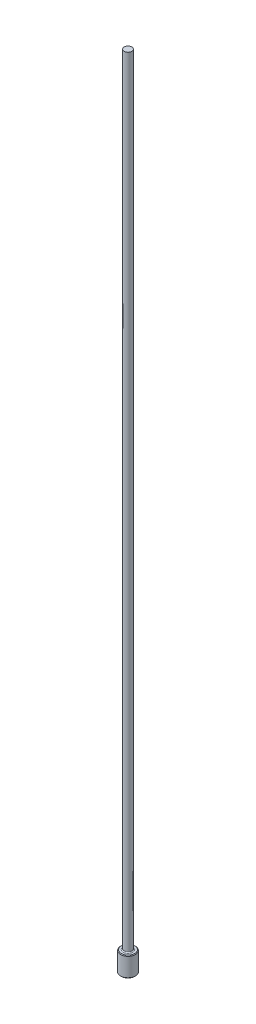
from build123d import *

# Parameters (mm, degrees)
CHAMFER1_SIZE = 0.0508
FILLET1_R     = 0.0762


with BuildPart() as part:
    # Sketch1 → Revolve1 (revolve)
    with BuildSketch(Plane.XY, mode=Mode.PRIVATE) as revolve1_sk:
        Polygon((0, 0), (-0.5842, 0), (-0.5842, 1.5748), (-0.3048, 1.5748), (-0.3048, 63.5), (0, 63.5), align=None)
    revolve(revolve1_sk.sketch.rotate(Axis((0, 259.958771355, 0), (0, -1, 0)), 270), axis=Axis((0, 259.958771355, 0), (0, -1, 0)))

    # Chamfer1
    chamfer1_edges = [part.edges().sort_by_distance(p)[0] for p in [
        (0, 1.5748, -0.5842),
        (0, 0, -0.5842),
    ]]
    chamfer(chamfer1_edges, length=CHAMFER1_SIZE)

    # Fillet1
    fillet1_edges = [part.edges().sort_by_distance(p)[0] for p in [
        (0, 1.5748, -0.3048),
    ]]
    fillet(fillet1_edges, radius=FILLET1_R)


solid = part.part
